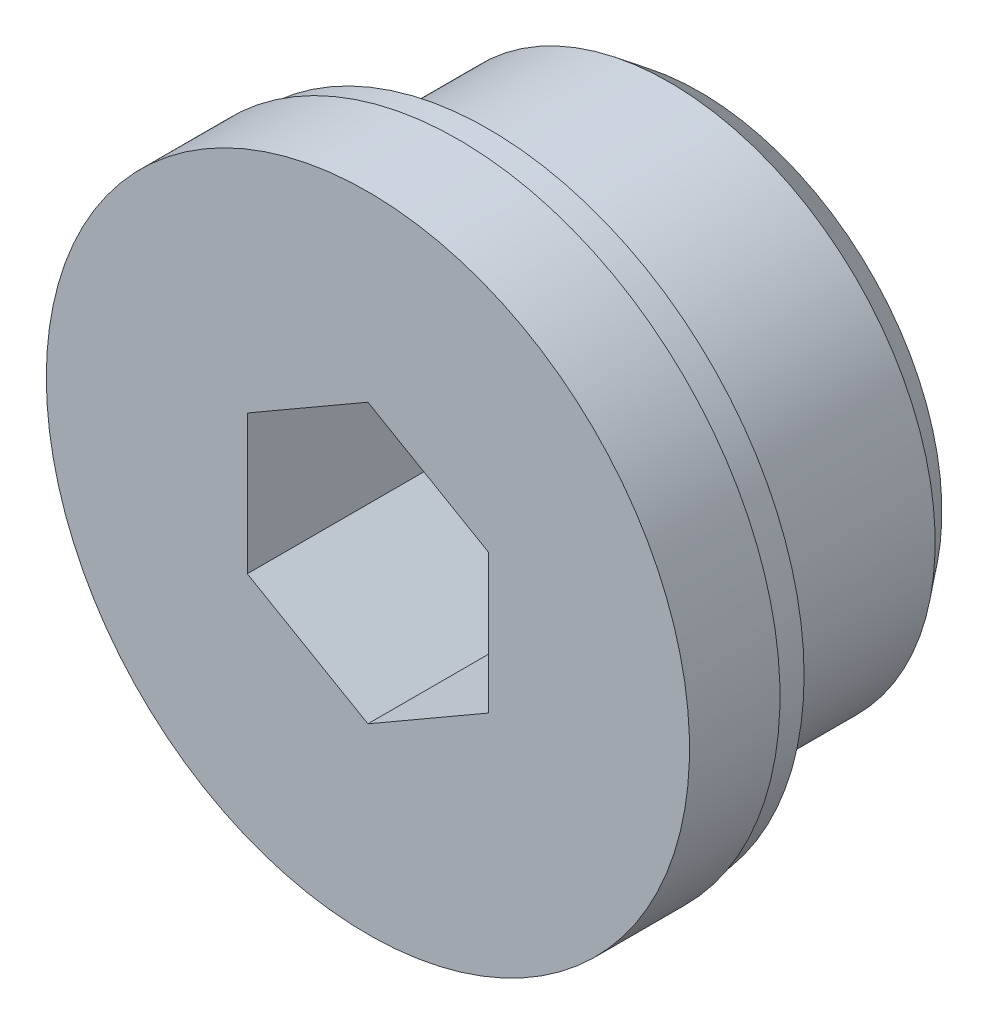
ISO-10303-21;
HEADER;
FILE_DESCRIPTION(('STEP AP214'),'2;1');
FILE_NAME('part.step','',(''),(''),'','','');
FILE_SCHEMA(('AUTOMOTIVE_DESIGN { 1 0 10303 214 1 1 1 1 }'));
ENDSEC;
DATA;
#1=APPLICATION_CONTEXT('core data for automotive mechanical design processes');
#2=APPLICATION_PROTOCOL_DEFINITION('international standard','automotive_design',2000,#1);
#3=PRODUCT_CONTEXT('',#1,'mechanical');
#4=PRODUCT('Part','Part','',(#3));
#5=PRODUCT_RELATED_PRODUCT_CATEGORY('part','',(#4));
#6=PRODUCT_DEFINITION_FORMATION('','',#4);
#7=PRODUCT_DEFINITION_CONTEXT('part definition',#1,'design');
#8=PRODUCT_DEFINITION('design','',#6,#7);
#9=PRODUCT_DEFINITION_SHAPE('','',#8);
#10=(LENGTH_UNIT() NAMED_UNIT(*) SI_UNIT(.MILLI.,.METRE.));
#11=(NAMED_UNIT(*) PLANE_ANGLE_UNIT() SI_UNIT($,.RADIAN.));
#12=(NAMED_UNIT(*) SI_UNIT($,.STERADIAN.) SOLID_ANGLE_UNIT());
#13=UNCERTAINTY_MEASURE_WITH_UNIT(LENGTH_MEASURE(1.E-05),#10,'distance_accuracy_value','');
#14=(GEOMETRIC_REPRESENTATION_CONTEXT(3) GLOBAL_UNCERTAINTY_ASSIGNED_CONTEXT((#13)) GLOBAL_UNIT_ASSIGNED_CONTEXT((#10,
#11,#12)) REPRESENTATION_CONTEXT('',''));
#15=CARTESIAN_POINT('',(0.,0.,0.));
#16=DIRECTION('',(0.,0.,1.));
#17=DIRECTION('',(1.,0.,0.));
#18=AXIS2_PLACEMENT_3D('',#15,#16,#17);
#19=CARTESIAN_POINT('',(0.,0.,0.));
#20=DIRECTION('',(0.,0.,-1.));
#21=DIRECTION('',(-1.,0.,0.));
#22=AXIS2_PLACEMENT_3D('',#19,#20,#21);
#23=CYLINDRICAL_SURFACE('',#22,15.7);
#24=CARTESIAN_POINT('',(0.,0.,1.50000000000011));
#25=DIRECTION('',(0.,0.,-1.));
#26=DIRECTION('',(-1.,0.,0.));
#27=AXIS2_PLACEMENT_3D('',#24,#25,#26);
#28=CIRCLE('',#27,15.7);
#29=CARTESIAN_POINT('',(-15.7,0.,1.50000000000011));
#30=VERTEX_POINT('',#29);
#31=EDGE_CURVE('E116',#30,#30,#28,.T.);
#32=ORIENTED_EDGE('',*,*,#31,.T.);
#33=EDGE_LOOP('',(#32));
#34=FACE_BOUND('',#33,.T.);
#35=CARTESIAN_POINT('',(0.,0.,1.09632577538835E-13));
#36=DIRECTION('',(0.,0.,-1.));
#37=DIRECTION('',(-1.,0.,0.));
#38=AXIS2_PLACEMENT_3D('',#35,#36,#37);
#39=CIRCLE('',#38,15.7);
#40=CARTESIAN_POINT('',(-15.7,0.,1.09632577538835E-13));
#41=VERTEX_POINT('',#40);
#42=EDGE_CURVE('E9',#41,#41,#39,.T.);
#43=ORIENTED_EDGE('',*,*,#42,.F.);
#44=EDGE_LOOP('',(#43));
#45=FACE_BOUND('',#44,.T.);
#46=ADVANCED_FACE('F14',(#34,#45),#23,.T.);
#47=CARTESIAN_POINT('',(0.,-15.7,1.09632577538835E-13));
#48=DIRECTION('',(0.,0.,-1.));
#49=DIRECTION('',(-1.,0.,0.));
#50=AXIS2_PLACEMENT_3D('',#47,#48,#49);
#51=PLANE('',#50);
#52=ORIENTED_EDGE('',*,*,#42,.T.);
#53=EDGE_LOOP('',(#52));
#54=FACE_BOUND('',#53,.T.);
#55=CARTESIAN_POINT('',(0.,0.,0.));
#56=DIRECTION('',(0.,0.,-1.));
#57=DIRECTION('',(-1.,0.,0.));
#58=AXIS2_PLACEMENT_3D('',#55,#56,#57);
#59=CIRCLE('',#58,13.22);
#60=CARTESIAN_POINT('',(-13.22,0.,0.));
#61=VERTEX_POINT('',#60);
#62=EDGE_CURVE('E21',#61,#61,#59,.T.);
#63=ORIENTED_EDGE('',*,*,#62,.F.);
#64=EDGE_LOOP('',(#63));
#65=FACE_BOUND('',#64,.T.);
#66=ADVANCED_FACE('F142',(#54,#65),#51,.T.);
#67=CARTESIAN_POINT('',(0.,0.,0.));
#68=DIRECTION('',(0.,0.,-1.));
#69=DIRECTION('',(-1.,0.,0.));
#70=AXIS2_PLACEMENT_3D('',#67,#68,#69);
#71=CYLINDRICAL_SURFACE('',#70,13.22);
#72=ORIENTED_EDGE('',*,*,#62,.T.);
#73=EDGE_LOOP('',(#72));
#74=FACE_BOUND('',#73,.T.);
#75=CARTESIAN_POINT('',(0.,0.,-9.));
#76=DIRECTION('',(0.,0.,-1.));
#77=DIRECTION('',(-1.,0.,0.));
#78=AXIS2_PLACEMENT_3D('',#75,#76,#77);
#79=CIRCLE('',#78,13.22);
#80=CARTESIAN_POINT('',(-13.22,0.,-9.));
#81=VERTEX_POINT('',#80);
#82=EDGE_CURVE('E134',#81,#81,#79,.T.);
#83=ORIENTED_EDGE('',*,*,#82,.F.);
#84=EDGE_LOOP('',(#83));
#85=FACE_BOUND('',#84,.T.);
#86=ADVANCED_FACE('F139',(#74,#85),#71,.T.);
#87=CARTESIAN_POINT('',(0.,0.,-10.5));
#88=DIRECTION('',(0.,0.,1.));
#89=DIRECTION('',(1.,0.,0.));
#90=AXIS2_PLACEMENT_3D('',#87,#88,#89);
#91=CONICAL_SURFACE('',#90,12.055,0.660350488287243);
#92=ORIENTED_EDGE('',*,*,#82,.T.);
#93=EDGE_LOOP('',(#92));
#94=FACE_BOUND('',#93,.T.);
#95=CARTESIAN_POINT('',(0.,0.,-10.5));
#96=DIRECTION('',(0.,0.,-1.));
#97=DIRECTION('',(-1.,0.,0.));
#98=AXIS2_PLACEMENT_3D('',#95,#96,#97);
#99=CIRCLE('',#98,12.055);
#100=CARTESIAN_POINT('',(-12.055,0.,-10.5));
#101=VERTEX_POINT('',#100);
#102=EDGE_CURVE('E131',#101,#101,#99,.T.);
#103=ORIENTED_EDGE('',*,*,#102,.F.);
#104=EDGE_LOOP('',(#103));
#105=FACE_BOUND('',#104,.T.);
#106=ADVANCED_FACE('F151',(#94,#105),#91,.T.);
#107=CARTESIAN_POINT('',(0.,0.,-10.5));
#108=DIRECTION('',(0.,0.,-1.));
#109=DIRECTION('',(-1.,0.,0.));
#110=AXIS2_PLACEMENT_3D('',#107,#108,#109);
#111=PLANE('',#110);
#112=ORIENTED_EDGE('',*,*,#102,.T.);
#113=EDGE_LOOP('',(#112));
#114=FACE_BOUND('',#113,.T.);
#115=ADVANCED_FACE('F157',(#114),#111,.T.);
#116=CARTESIAN_POINT('',(0.,-16.,6.0000000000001));
#117=DIRECTION('',(0.,0.,1.));
#118=DIRECTION('',(1.,0.,0.));
#119=AXIS2_PLACEMENT_3D('',#116,#117,#118);
#120=PLANE('',#119);
#121=DIRECTION('',(-0.866025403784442,0.5,0.));
#122=VECTOR('',#121,1.);
#123=CARTESIAN_POINT('',(6.,3.46410161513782,6.0000000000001));
#124=LINE('',#123,#122);
#125=CARTESIAN_POINT('',(6.,3.46410161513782,6.0000000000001));
#126=VERTEX_POINT('',#125);
#127=CARTESIAN_POINT('',(0.,6.92820323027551,6.0000000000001));
#128=VERTEX_POINT('',#127);
#129=EDGE_CURVE('E28',#126,#128,#124,.T.);
#130=ORIENTED_EDGE('',*,*,#129,.F.);
#131=DIRECTION('',(0.,1.,0.));
#132=VECTOR('',#131,1.);
#133=CARTESIAN_POINT('',(6.,-3.46410161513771,6.0000000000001));
#134=LINE('',#133,#132);
#135=CARTESIAN_POINT('',(6.,-3.46410161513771,6.0000000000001));
#136=VERTEX_POINT('',#135);
#137=EDGE_CURVE('E98',#136,#126,#134,.T.);
#138=ORIENTED_EDGE('',*,*,#137,.F.);
#139=DIRECTION('',(0.866025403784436,0.5,0.));
#140=VECTOR('',#139,1.);
#141=CARTESIAN_POINT('',(0.,-6.92820323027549,6.0000000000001));
#142=LINE('',#141,#140);
#143=CARTESIAN_POINT('',(0.,-6.92820323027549,6.0000000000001));
#144=VERTEX_POINT('',#143);
#145=EDGE_CURVE('E92',#144,#136,#142,.T.);
#146=ORIENTED_EDGE('',*,*,#145,.F.);
#147=DIRECTION('',(0.866025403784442,-0.5,0.));
#148=VECTOR('',#147,1.);
#149=CARTESIAN_POINT('',(-6.,-3.46410161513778,6.0000000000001));
#150=LINE('',#149,#148);
#151=CARTESIAN_POINT('',(-6.,-3.46410161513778,6.0000000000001));
#152=VERTEX_POINT('',#151);
#153=EDGE_CURVE('E90',#152,#144,#150,.T.);
#154=ORIENTED_EDGE('',*,*,#153,.F.);
#155=DIRECTION('',(0.,-1.,0.));
#156=VECTOR('',#155,1.);
#157=CARTESIAN_POINT('',(-6.,3.46410161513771,6.0000000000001));
#158=LINE('',#157,#156);
#159=CARTESIAN_POINT('',(-6.,3.46410161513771,6.0000000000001));
#160=VERTEX_POINT('',#159);
#161=EDGE_CURVE('E71',#160,#152,#158,.T.);
#162=ORIENTED_EDGE('',*,*,#161,.F.);
#163=DIRECTION('',(-0.866025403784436,-0.5,0.));
#164=VECTOR('',#163,1.);
#165=CARTESIAN_POINT('',(0.,6.92820323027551,6.0000000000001));
#166=LINE('',#165,#164);
#167=EDGE_CURVE('E82',#128,#160,#166,.T.);
#168=ORIENTED_EDGE('',*,*,#167,.F.);
#169=EDGE_LOOP('',(#130,#138,#146,#154,#162,#168));
#170=FACE_BOUND('',#169,.T.);
#171=CARTESIAN_POINT('',(0.,0.,6.0000000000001));
#172=DIRECTION('',(0.,0.,-1.));
#173=DIRECTION('',(-1.,0.,0.));
#174=AXIS2_PLACEMENT_3D('',#171,#172,#173);
#175=CIRCLE('',#174,16.);
#176=CARTESIAN_POINT('',(-16.,0.,6.0000000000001));
#177=VERTEX_POINT('',#176);
#178=EDGE_CURVE('E128',#177,#177,#175,.T.);
#179=ORIENTED_EDGE('',*,*,#178,.F.);
#180=EDGE_LOOP('',(#179));
#181=FACE_BOUND('',#180,.T.);
#182=ADVANCED_FACE('F86',(#170,#181),#120,.T.);
#183=CARTESIAN_POINT('',(0.,0.,0.));
#184=DIRECTION('',(0.,0.,-1.));
#185=DIRECTION('',(-1.,0.,0.));
#186=AXIS2_PLACEMENT_3D('',#183,#184,#185);
#187=CYLINDRICAL_SURFACE('',#186,16.);
#188=ORIENTED_EDGE('',*,*,#178,.T.);
#189=EDGE_LOOP('',(#188));
#190=FACE_BOUND('',#189,.T.);
#191=CARTESIAN_POINT('',(0.,0.,1.50000000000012));
#192=DIRECTION('',(0.,0.,-1.));
#193=DIRECTION('',(-1.,0.,0.));
#194=AXIS2_PLACEMENT_3D('',#191,#192,#193);
#195=CIRCLE('',#194,16.);
#196=CARTESIAN_POINT('',(-16.,0.,1.50000000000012));
#197=VERTEX_POINT('',#196);
#198=EDGE_CURVE('E125',#197,#197,#195,.T.);
#199=ORIENTED_EDGE('',*,*,#198,.F.);
#200=EDGE_LOOP('',(#199));
#201=FACE_BOUND('',#200,.T.);
#202=ADVANCED_FACE('F164',(#190,#201),#187,.T.);
#203=CARTESIAN_POINT('',(0.,-16.,1.50000000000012));
#204=DIRECTION('',(0.,0.,-1.));
#205=DIRECTION('',(-1.,0.,0.));
#206=AXIS2_PLACEMENT_3D('',#203,#204,#205);
#207=PLANE('',#206);
#208=ORIENTED_EDGE('',*,*,#198,.T.);
#209=EDGE_LOOP('',(#208));
#210=FACE_BOUND('',#209,.T.);
#211=ORIENTED_EDGE('',*,*,#31,.F.);
#212=EDGE_LOOP('',(#211));
#213=FACE_BOUND('',#212,.T.);
#214=ADVANCED_FACE('F167',(#210,#213),#207,.T.);
#215=CARTESIAN_POINT('',(6.,3.46410161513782,-5.9999999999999));
#216=DIRECTION('',(0.5,0.866025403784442,0.));
#217=DIRECTION('',(-0.866025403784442,0.5,0.));
#218=AXIS2_PLACEMENT_3D('',#215,#216,#217);
#219=PLANE('',#218);
#220=ORIENTED_EDGE('',*,*,#129,.T.);
#221=DIRECTION('',(0.,0.,1.));
#222=VECTOR('',#221,1.);
#223=CARTESIAN_POINT('',(0.,6.92820323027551,-5.9999999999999));
#224=LINE('',#223,#222);
#225=CARTESIAN_POINT('',(0.,6.92820323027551,-5.9999999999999));
#226=VERTEX_POINT('',#225);
#227=EDGE_CURVE('E79',#226,#128,#224,.T.);
#228=ORIENTED_EDGE('',*,*,#227,.F.);
#229=DIRECTION('',(-0.866025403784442,0.5,0.));
#230=VECTOR('',#229,1.);
#231=CARTESIAN_POINT('',(6.,3.46410161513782,-5.9999999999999));
#232=LINE('',#231,#230);
#233=CARTESIAN_POINT('',(6.,3.46410161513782,-5.9999999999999));
#234=VERTEX_POINT('',#233);
#235=EDGE_CURVE('E100',#234,#226,#232,.T.);
#236=ORIENTED_EDGE('',*,*,#235,.F.);
#237=DIRECTION('',(0.,0.,1.));
#238=VECTOR('',#237,1.);
#239=CARTESIAN_POINT('',(6.,3.46410161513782,-5.9999999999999));
#240=LINE('',#239,#238);
#241=EDGE_CURVE('E35',#234,#126,#240,.T.);
#242=ORIENTED_EDGE('',*,*,#241,.T.);
#243=EDGE_LOOP('',(#220,#228,#236,#242));
#244=FACE_BOUND('',#243,.T.);
#245=ADVANCED_FACE('F171',(#244),#219,.F.);
#246=CARTESIAN_POINT('',(6.,-3.46410161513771,-5.9999999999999));
#247=DIRECTION('',(1.,0.,0.));
#248=DIRECTION('',(0.,1.,0.));
#249=AXIS2_PLACEMENT_3D('',#246,#247,#248);
#250=PLANE('',#249);
#251=ORIENTED_EDGE('',*,*,#137,.T.);
#252=ORIENTED_EDGE('',*,*,#241,.F.);
#253=DIRECTION('',(0.,1.,0.));
#254=VECTOR('',#253,1.);
#255=CARTESIAN_POINT('',(6.,-3.46410161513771,-5.9999999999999));
#256=LINE('',#255,#254);
#257=CARTESIAN_POINT('',(6.,-3.46410161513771,-5.9999999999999));
#258=VERTEX_POINT('',#257);
#259=EDGE_CURVE('E112',#258,#234,#256,.T.);
#260=ORIENTED_EDGE('',*,*,#259,.F.);
#261=DIRECTION('',(0.,0.,1.));
#262=VECTOR('',#261,1.);
#263=CARTESIAN_POINT('',(6.,-3.46410161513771,-5.9999999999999));
#264=LINE('',#263,#262);
#265=EDGE_CURVE('E117',#258,#136,#264,.T.);
#266=ORIENTED_EDGE('',*,*,#265,.T.);
#267=EDGE_LOOP('',(#251,#252,#260,#266));
#268=FACE_BOUND('',#267,.T.);
#269=ADVANCED_FACE('F175',(#268),#250,.F.);
#270=CARTESIAN_POINT('',(0.,-6.92820323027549,-5.9999999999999));
#271=DIRECTION('',(0.5,-0.866025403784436,0.));
#272=DIRECTION('',(0.866025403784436,0.5,0.));
#273=AXIS2_PLACEMENT_3D('',#270,#271,#272);
#274=PLANE('',#273);
#275=ORIENTED_EDGE('',*,*,#145,.T.);
#276=ORIENTED_EDGE('',*,*,#265,.F.);
#277=DIRECTION('',(0.866025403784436,0.5,0.));
#278=VECTOR('',#277,1.);
#279=CARTESIAN_POINT('',(0.,-6.92820323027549,-5.9999999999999));
#280=LINE('',#279,#278);
#281=CARTESIAN_POINT('',(0.,-6.92820323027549,-5.9999999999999));
#282=VERTEX_POINT('',#281);
#283=EDGE_CURVE('E109',#282,#258,#280,.T.);
#284=ORIENTED_EDGE('',*,*,#283,.F.);
#285=DIRECTION('',(0.,0.,1.));
#286=VECTOR('',#285,1.);
#287=CARTESIAN_POINT('',(0.,-6.92820323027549,-5.9999999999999));
#288=LINE('',#287,#286);
#289=EDGE_CURVE('E119',#282,#144,#288,.T.);
#290=ORIENTED_EDGE('',*,*,#289,.T.);
#291=EDGE_LOOP('',(#275,#276,#284,#290));
#292=FACE_BOUND('',#291,.T.);
#293=ADVANCED_FACE('F184',(#292),#274,.F.);
#294=CARTESIAN_POINT('',(-6.,-3.46410161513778,-5.9999999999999));
#295=DIRECTION('',(-0.5,-0.866025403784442,0.));
#296=DIRECTION('',(0.866025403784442,-0.5,0.));
#297=AXIS2_PLACEMENT_3D('',#294,#295,#296);
#298=PLANE('',#297);
#299=ORIENTED_EDGE('',*,*,#153,.T.);
#300=ORIENTED_EDGE('',*,*,#289,.F.);
#301=DIRECTION('',(0.866025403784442,-0.5,0.));
#302=VECTOR('',#301,1.);
#303=CARTESIAN_POINT('',(-6.,-3.46410161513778,-5.9999999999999));
#304=LINE('',#303,#302);
#305=CARTESIAN_POINT('',(-6.,-3.46410161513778,-5.9999999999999));
#306=VERTEX_POINT('',#305);
#307=EDGE_CURVE('E106',#306,#282,#304,.T.);
#308=ORIENTED_EDGE('',*,*,#307,.F.);
#309=DIRECTION('',(0.,0.,1.));
#310=VECTOR('',#309,1.);
#311=CARTESIAN_POINT('',(-6.,-3.46410161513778,-5.9999999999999));
#312=LINE('',#311,#310);
#313=EDGE_CURVE('E78',#306,#152,#312,.T.);
#314=ORIENTED_EDGE('',*,*,#313,.T.);
#315=EDGE_LOOP('',(#299,#300,#308,#314));
#316=FACE_BOUND('',#315,.T.);
#317=ADVANCED_FACE('F181',(#316),#298,.F.);
#318=CARTESIAN_POINT('',(-6.,3.46410161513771,-5.9999999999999));
#319=DIRECTION('',(-1.,0.,0.));
#320=DIRECTION('',(0.,-1.,0.));
#321=AXIS2_PLACEMENT_3D('',#318,#319,#320);
#322=PLANE('',#321);
#323=ORIENTED_EDGE('',*,*,#161,.T.);
#324=ORIENTED_EDGE('',*,*,#313,.F.);
#325=DIRECTION('',(0.,-1.,0.));
#326=VECTOR('',#325,1.);
#327=CARTESIAN_POINT('',(-6.,3.46410161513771,-5.9999999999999));
#328=LINE('',#327,#326);
#329=CARTESIAN_POINT('',(-6.,3.46410161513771,-5.9999999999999));
#330=VERTEX_POINT('',#329);
#331=EDGE_CURVE('E74',#330,#306,#328,.T.);
#332=ORIENTED_EDGE('',*,*,#331,.F.);
#333=DIRECTION('',(0.,0.,1.));
#334=VECTOR('',#333,1.);
#335=CARTESIAN_POINT('',(-6.,3.46410161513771,-5.9999999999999));
#336=LINE('',#335,#334);
#337=EDGE_CURVE('E67',#330,#160,#336,.T.);
#338=ORIENTED_EDGE('',*,*,#337,.T.);
#339=EDGE_LOOP('',(#323,#324,#332,#338));
#340=FACE_BOUND('',#339,.T.);
#341=ADVANCED_FACE('F69',(#340),#322,.F.);
#342=CARTESIAN_POINT('',(0.,6.92820323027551,-5.9999999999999));
#343=DIRECTION('',(-0.5,0.866025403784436,0.));
#344=DIRECTION('',(-0.866025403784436,-0.5,0.));
#345=AXIS2_PLACEMENT_3D('',#342,#343,#344);
#346=PLANE('',#345);
#347=ORIENTED_EDGE('',*,*,#167,.T.);
#348=ORIENTED_EDGE('',*,*,#337,.F.);
#349=DIRECTION('',(-0.866025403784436,-0.5,0.));
#350=VECTOR('',#349,1.);
#351=CARTESIAN_POINT('',(0.,6.92820323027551,-5.9999999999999));
#352=LINE('',#351,#350);
#353=EDGE_CURVE('E103',#226,#330,#352,.T.);
#354=ORIENTED_EDGE('',*,*,#353,.F.);
#355=ORIENTED_EDGE('',*,*,#227,.T.);
#356=EDGE_LOOP('',(#347,#348,#354,#355));
#357=FACE_BOUND('',#356,.T.);
#358=ADVANCED_FACE('F83',(#357),#346,.F.);
#359=CARTESIAN_POINT('',(0.,6.92820323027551,-5.9999999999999));
#360=DIRECTION('',(0.,0.,1.));
#361=DIRECTION('',(1.,0.,0.));
#362=AXIS2_PLACEMENT_3D('',#359,#360,#361);
#363=PLANE('',#362);
#364=ORIENTED_EDGE('',*,*,#235,.T.);
#365=ORIENTED_EDGE('',*,*,#353,.T.);
#366=ORIENTED_EDGE('',*,*,#331,.T.);
#367=ORIENTED_EDGE('',*,*,#307,.T.);
#368=ORIENTED_EDGE('',*,*,#283,.T.);
#369=ORIENTED_EDGE('',*,*,#259,.T.);
#370=EDGE_LOOP('',(#364,#365,#366,#367,#368,#369));
#371=FACE_BOUND('',#370,.T.);
#372=ADVANCED_FACE('F178',(#371),#363,.T.);
#373=CLOSED_SHELL('',(#46,#66,#86,#106,#115,#182,#202,#214,#245,#269,#293,#317,#341,#358,#372));
#374=MANIFOLD_SOLID_BREP('B1',#373);
#375=ADVANCED_BREP_SHAPE_REPRESENTATION('',(#18,#374),#14);
#376=SHAPE_DEFINITION_REPRESENTATION(#9,#375);
ENDSEC;
END-ISO-10303-21;
